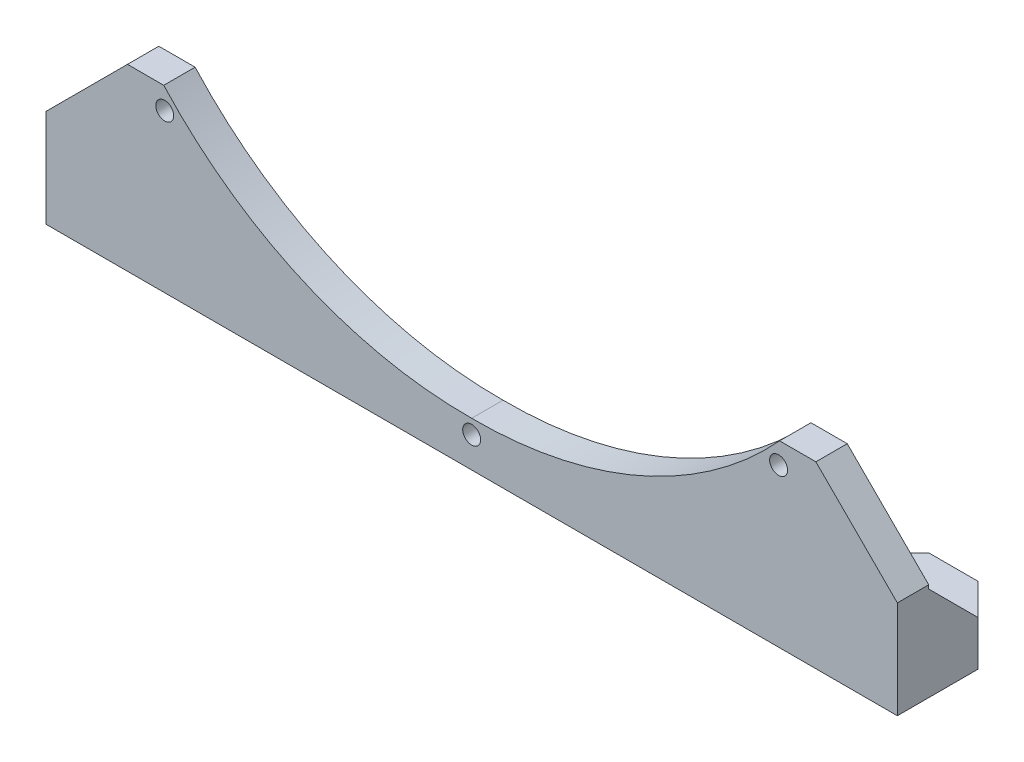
ISO-10303-21;
HEADER;
FILE_DESCRIPTION(('STEP AP214'),'2;1');
FILE_NAME('part.step','',(''),(''),'','','');
FILE_SCHEMA(('AUTOMOTIVE_DESIGN { 1 0 10303 214 1 1 1 1 }'));
ENDSEC;
DATA;
#1=APPLICATION_CONTEXT('core data for automotive mechanical design processes');
#2=APPLICATION_PROTOCOL_DEFINITION('international standard','automotive_design',2000,#1);
#3=PRODUCT_CONTEXT('',#1,'mechanical');
#4=PRODUCT('Part','Part','',(#3));
#5=PRODUCT_RELATED_PRODUCT_CATEGORY('part','',(#4));
#6=PRODUCT_DEFINITION_FORMATION('','',#4);
#7=PRODUCT_DEFINITION_CONTEXT('part definition',#1,'design');
#8=PRODUCT_DEFINITION('design','',#6,#7);
#9=PRODUCT_DEFINITION_SHAPE('','',#8);
#10=(LENGTH_UNIT() NAMED_UNIT(*) SI_UNIT(.MILLI.,.METRE.));
#11=(NAMED_UNIT(*) PLANE_ANGLE_UNIT() SI_UNIT($,.RADIAN.));
#12=(NAMED_UNIT(*) SI_UNIT($,.STERADIAN.) SOLID_ANGLE_UNIT());
#13=UNCERTAINTY_MEASURE_WITH_UNIT(LENGTH_MEASURE(1.E-05),#10,'distance_accuracy_value','');
#14=(GEOMETRIC_REPRESENTATION_CONTEXT(3) GLOBAL_UNCERTAINTY_ASSIGNED_CONTEXT((#13)) GLOBAL_UNIT_ASSIGNED_CONTEXT((#10,
#11,#12)) REPRESENTATION_CONTEXT('',''));
#15=CARTESIAN_POINT('',(0.,0.,0.));
#16=DIRECTION('',(0.,0.,1.));
#17=DIRECTION('',(1.,0.,0.));
#18=AXIS2_PLACEMENT_3D('',#15,#16,#17);
#19=CARTESIAN_POINT('',(0.,-123.0376,8.89));
#20=DIRECTION('',(0.,0.,-1.));
#21=DIRECTION('',(-1.,0.,0.));
#22=AXIS2_PLACEMENT_3D('',#19,#20,#21);
#23=CYLINDRICAL_SURFACE('',#22,2.286);
#24=CARTESIAN_POINT('',(0.,-123.0376,0.));
#25=DIRECTION('',(0.,0.,1.));
#26=DIRECTION('',(1.,0.,0.));
#27=AXIS2_PLACEMENT_3D('',#24,#25,#26);
#28=CIRCLE('',#27,2.286);
#29=CARTESIAN_POINT('',(2.28600000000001,-123.0376,0.));
#30=VERTEX_POINT('',#29);
#31=EDGE_CURVE('E232',#30,#30,#28,.T.);
#32=ORIENTED_EDGE('',*,*,#31,.F.);
#33=EDGE_LOOP('',(#32));
#34=FACE_BOUND('',#33,.T.);
#35=CARTESIAN_POINT('',(0.,-123.0376,4.318));
#36=DIRECTION('',(0.,0.,1.));
#37=DIRECTION('',(1.,0.,0.));
#38=AXIS2_PLACEMENT_3D('',#35,#36,#37);
#39=CIRCLE('',#38,2.286);
#40=CARTESIAN_POINT('',(2.28600000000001,-123.0376,4.318));
#41=VERTEX_POINT('',#40);
#42=EDGE_CURVE('E337',#41,#41,#39,.T.);
#43=ORIENTED_EDGE('',*,*,#42,.T.);
#44=EDGE_LOOP('',(#43));
#45=FACE_BOUND('',#44,.T.);
#46=ADVANCED_FACE('F33',(#34,#45),#23,.F.);
#47=CARTESIAN_POINT('',(-87.0007213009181,-87.0007213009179,8.89));
#48=DIRECTION('',(0.,0.,-1.));
#49=DIRECTION('',(-1.,0.,0.));
#50=AXIS2_PLACEMENT_3D('',#47,#48,#49);
#51=CYLINDRICAL_SURFACE('',#50,2.28599999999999);
#52=CARTESIAN_POINT('',(-87.0007213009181,-87.0007213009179,0.));
#53=DIRECTION('',(0.,0.,1.));
#54=DIRECTION('',(1.,0.,0.));
#55=AXIS2_PLACEMENT_3D('',#52,#53,#54);
#56=CIRCLE('',#55,2.28599999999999);
#57=CARTESIAN_POINT('',(-84.7147213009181,-87.0007213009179,0.));
#58=VERTEX_POINT('',#57);
#59=EDGE_CURVE('E229',#58,#58,#56,.T.);
#60=ORIENTED_EDGE('',*,*,#59,.F.);
#61=EDGE_LOOP('',(#60));
#62=FACE_BOUND('',#61,.T.);
#63=CARTESIAN_POINT('',(-87.0007213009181,-87.0007213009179,4.318));
#64=DIRECTION('',(0.,0.,1.));
#65=DIRECTION('',(1.,0.,0.));
#66=AXIS2_PLACEMENT_3D('',#63,#64,#65);
#67=CIRCLE('',#66,2.28599999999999);
#68=CARTESIAN_POINT('',(-84.7147213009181,-87.0007213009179,4.318));
#69=VERTEX_POINT('',#68);
#70=EDGE_CURVE('E371',#69,#69,#67,.T.);
#71=ORIENTED_EDGE('',*,*,#70,.T.);
#72=EDGE_LOOP('',(#71));
#73=FACE_BOUND('',#72,.T.);
#74=ADVANCED_FACE('F393',(#62,#73),#51,.F.);
#75=CARTESIAN_POINT('',(87.0007213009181,-87.0007213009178,8.89));
#76=DIRECTION('',(0.,0.,-1.));
#77=DIRECTION('',(-1.,0.,0.));
#78=AXIS2_PLACEMENT_3D('',#75,#76,#77);
#79=CYLINDRICAL_SURFACE('',#78,2.28599999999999);
#80=CARTESIAN_POINT('',(87.0007213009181,-87.0007213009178,0.));
#81=DIRECTION('',(0.,0.,1.));
#82=DIRECTION('',(-1.,0.,0.));
#83=AXIS2_PLACEMENT_3D('',#80,#81,#82);
#84=CIRCLE('',#83,2.28599999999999);
#85=CARTESIAN_POINT('',(84.7147213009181,-87.0007213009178,0.));
#86=VERTEX_POINT('',#85);
#87=EDGE_CURVE('E224',#86,#86,#84,.T.);
#88=ORIENTED_EDGE('',*,*,#87,.F.);
#89=EDGE_LOOP('',(#88));
#90=FACE_BOUND('',#89,.T.);
#91=CARTESIAN_POINT('',(87.0007213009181,-87.0007213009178,4.318));
#92=DIRECTION('',(0.,0.,1.));
#93=DIRECTION('',(1.,0.,0.));
#94=AXIS2_PLACEMENT_3D('',#91,#92,#93);
#95=CIRCLE('',#94,2.28599999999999);
#96=CARTESIAN_POINT('',(89.2867213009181,-87.0007213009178,4.318));
#97=VERTEX_POINT('',#96);
#98=EDGE_CURVE('E192',#97,#97,#95,.T.);
#99=ORIENTED_EDGE('',*,*,#98,.T.);
#100=EDGE_LOOP('',(#99));
#101=FACE_BOUND('',#100,.T.);
#102=ADVANCED_FACE('F399',(#90,#101),#79,.F.);
#103=CARTESIAN_POINT('',(-0.948520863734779,-2.17249578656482,8.89));
#104=DIRECTION('',(0.,0.,1.));
#105=DIRECTION('',(1.,0.,0.));
#106=AXIS2_PLACEMENT_3D('',#103,#104,#105);
#107=PLANE('',#106);
#108=CARTESIAN_POINT('',(-87.0007213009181,-87.0007213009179,8.89));
#109=DIRECTION('',(0.,0.,1.));
#110=DIRECTION('',(1.,0.,0.));
#111=AXIS2_PLACEMENT_3D('',#108,#109,#110);
#112=CIRCLE('',#111,2.53999999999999);
#113=CARTESIAN_POINT('',(-84.4607213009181,-87.0007213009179,8.89));
#114=VERTEX_POINT('',#113);
#115=EDGE_CURVE('E193',#114,#114,#112,.T.);
#116=ORIENTED_EDGE('',*,*,#115,.F.);
#117=EDGE_LOOP('',(#116));
#118=FACE_BOUND('',#117,.T.);
#119=CARTESIAN_POINT('',(0.,-123.0376,8.89));
#120=DIRECTION('',(0.,0.,1.));
#121=DIRECTION('',(1.,0.,0.));
#122=AXIS2_PLACEMENT_3D('',#119,#120,#121);
#123=CIRCLE('',#122,2.54);
#124=CARTESIAN_POINT('',(2.54000000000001,-123.0376,8.89));
#125=VERTEX_POINT('',#124);
#126=EDGE_CURVE('E199',#125,#125,#123,.T.);
#127=ORIENTED_EDGE('',*,*,#126,.F.);
#128=EDGE_LOOP('',(#127));
#129=FACE_BOUND('',#128,.T.);
#130=CARTESIAN_POINT('',(87.0007213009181,-87.0007213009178,8.89));
#131=DIRECTION('',(0.,0.,1.));
#132=DIRECTION('',(1.,0.,0.));
#133=AXIS2_PLACEMENT_3D('',#130,#131,#132);
#134=CIRCLE('',#133,2.53999999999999);
#135=CARTESIAN_POINT('',(89.5407213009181,-87.0007213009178,8.89));
#136=VERTEX_POINT('',#135);
#137=EDGE_CURVE('E188',#136,#136,#134,.T.);
#138=ORIENTED_EDGE('',*,*,#137,.F.);
#139=EDGE_LOOP('',(#138));
#140=FACE_BOUND('',#139,.T.);
#141=DIRECTION('',(1.,0.,0.));
#142=VECTOR('',#141,1.);
#143=CARTESIAN_POINT('',(120.65,-131.708645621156,8.89));
#144=LINE('',#143,#142);
#145=CARTESIAN_POINT('',(-120.65,-131.708645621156,8.89));
#146=VERTEX_POINT('',#145);
#147=CARTESIAN_POINT('',(120.65,-131.708645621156,8.89));
#148=VERTEX_POINT('',#147);
#149=EDGE_CURVE('E246',#146,#148,#144,.T.);
#150=ORIENTED_EDGE('',*,*,#149,.T.);
#151=DIRECTION('',(0.,1.,0.));
#152=VECTOR('',#151,1.);
#153=CARTESIAN_POINT('',(120.65,-131.708645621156,8.89));
#154=LINE('',#153,#152);
#155=CARTESIAN_POINT('',(120.65,-103.996642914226,8.89));
#156=VERTEX_POINT('',#155);
#157=EDGE_CURVE('E248',#148,#156,#154,.T.);
#158=ORIENTED_EDGE('',*,*,#157,.T.);
#159=DIRECTION('',(-0.707106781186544,0.707106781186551,0.));
#160=VECTOR('',#159,1.);
#161=CARTESIAN_POINT('',(97.5620027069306,-80.9086456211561,8.89));
#162=LINE('',#161,#160);
#163=CARTESIAN_POINT('',(97.5620027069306,-80.9086456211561,8.89));
#164=VERTEX_POINT('',#163);
#165=EDGE_CURVE('E250',#156,#164,#162,.T.);
#166=ORIENTED_EDGE('',*,*,#165,.T.);
#167=DIRECTION('',(-1.,0.,0.));
#168=VECTOR('',#167,1.);
#169=CARTESIAN_POINT('',(87.2746716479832,-80.9086456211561,8.89));
#170=LINE('',#169,#168);
#171=CARTESIAN_POINT('',(87.2746716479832,-80.9086456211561,8.89));
#172=VERTEX_POINT('',#171);
#173=EDGE_CURVE('E252',#164,#172,#170,.T.);
#174=ORIENTED_EDGE('',*,*,#173,.T.);
#175=CARTESIAN_POINT('',(0.94852086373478,-2.17249578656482,8.89));
#176=DIRECTION('',(0.,0.,-1.));
#177=DIRECTION('',(-1.,0.,0.));
#178=AXIS2_PLACEMENT_3D('',#175,#176,#177);
#179=CIRCLE('',#178,116.84);
#180=CARTESIAN_POINT('',(0.,-119.008645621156,8.89));
#181=VERTEX_POINT('',#180);
#182=EDGE_CURVE('E254',#172,#181,#179,.T.);
#183=ORIENTED_EDGE('',*,*,#182,.T.);
#184=CARTESIAN_POINT('',(-0.948520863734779,-2.17249578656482,8.89));
#185=DIRECTION('',(0.,0.,-1.));
#186=DIRECTION('',(1.,0.,0.));
#187=AXIS2_PLACEMENT_3D('',#184,#185,#186);
#188=CIRCLE('',#187,116.84);
#189=CARTESIAN_POINT('',(-87.2746716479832,-80.9086456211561,8.89));
#190=VERTEX_POINT('',#189);
#191=EDGE_CURVE('E236',#181,#190,#188,.T.);
#192=ORIENTED_EDGE('',*,*,#191,.T.);
#193=DIRECTION('',(-1.,0.,0.));
#194=VECTOR('',#193,1.);
#195=CARTESIAN_POINT('',(-87.2746716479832,-80.9086456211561,8.89));
#196=LINE('',#195,#194);
#197=CARTESIAN_POINT('',(-97.56200270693,-80.908645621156,8.89));
#198=VERTEX_POINT('',#197);
#199=EDGE_CURVE('E239',#190,#198,#196,.T.);
#200=ORIENTED_EDGE('',*,*,#199,.T.);
#201=DIRECTION('',(-0.707106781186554,-0.707106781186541,0.));
#202=VECTOR('',#201,1.);
#203=CARTESIAN_POINT('',(-97.56200270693,-80.908645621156,8.89));
#204=LINE('',#203,#202);
#205=CARTESIAN_POINT('',(-120.65,-103.996642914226,8.89));
#206=VERTEX_POINT('',#205);
#207=EDGE_CURVE('E242',#198,#206,#204,.T.);
#208=ORIENTED_EDGE('',*,*,#207,.T.);
#209=DIRECTION('',(0.,-1.,0.));
#210=VECTOR('',#209,1.);
#211=CARTESIAN_POINT('',(-120.65,-131.708645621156,8.89));
#212=LINE('',#211,#210);
#213=EDGE_CURVE('E244',#206,#146,#212,.T.);
#214=ORIENTED_EDGE('',*,*,#213,.T.);
#215=EDGE_LOOP('',(#150,#158,#166,#174,#183,#192,#200,#208,#214));
#216=FACE_BOUND('',#215,.T.);
#217=ADVANCED_FACE('F406',(#118,#129,#140,#216),#107,.T.);
#218=CARTESIAN_POINT('',(-0.948520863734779,-2.17249578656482,0.));
#219=DIRECTION('',(0.,0.,1.));
#220=DIRECTION('',(1.,0.,0.));
#221=AXIS2_PLACEMENT_3D('',#218,#219,#220);
#222=PLANE('',#221);
#223=DIRECTION('',(1.,0.,0.));
#224=VECTOR('',#223,1.);
#225=CARTESIAN_POINT('',(120.65,-131.708645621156,0.));
#226=LINE('',#225,#224);
#227=CARTESIAN_POINT('',(-74.93,-131.708645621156,0.));
#228=VERTEX_POINT('',#227);
#229=CARTESIAN_POINT('',(74.9299999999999,-131.708645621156,0.));
#230=VERTEX_POINT('',#229);
#231=EDGE_CURVE('E266',#228,#230,#226,.T.);
#232=ORIENTED_EDGE('',*,*,#231,.F.);
#233=DIRECTION('',(0.,1.,0.));
#234=VECTOR('',#233,1.);
#235=CARTESIAN_POINT('',(-74.9300000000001,-2.17249578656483,0.));
#236=LINE('',#235,#234);
#237=CARTESIAN_POINT('',(-74.9300000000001,-105.038645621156,0.));
#238=VERTEX_POINT('',#237);
#239=EDGE_CURVE('E309',#228,#238,#236,.T.);
#240=ORIENTED_EDGE('',*,*,#239,.T.);
#241=DIRECTION('',(-1.,0.,0.));
#242=VECTOR('',#241,1.);
#243=CARTESIAN_POINT('',(-120.65,-105.038645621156,0.));
#244=LINE('',#243,#242);
#245=CARTESIAN_POINT('',(-120.65,-105.038645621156,0.));
#246=VERTEX_POINT('',#245);
#247=EDGE_CURVE('E307',#238,#246,#244,.T.);
#248=ORIENTED_EDGE('',*,*,#247,.T.);
#249=DIRECTION('',(0.,-1.,0.));
#250=VECTOR('',#249,1.);
#251=CARTESIAN_POINT('',(-120.65,-131.708645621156,0.));
#252=LINE('',#251,#250);
#253=CARTESIAN_POINT('',(-120.65,-103.996642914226,0.));
#254=VERTEX_POINT('',#253);
#255=EDGE_CURVE('E263',#254,#246,#252,.T.);
#256=ORIENTED_EDGE('',*,*,#255,.F.);
#257=DIRECTION('',(-0.707106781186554,-0.707106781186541,0.));
#258=VECTOR('',#257,1.);
#259=CARTESIAN_POINT('',(-97.56200270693,-80.908645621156,0.));
#260=LINE('',#259,#258);
#261=CARTESIAN_POINT('',(-97.56200270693,-80.908645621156,0.));
#262=VERTEX_POINT('',#261);
#263=EDGE_CURVE('E261',#262,#254,#260,.T.);
#264=ORIENTED_EDGE('',*,*,#263,.F.);
#265=DIRECTION('',(-1.,0.,0.));
#266=VECTOR('',#265,1.);
#267=CARTESIAN_POINT('',(-87.2746716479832,-80.9086456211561,0.));
#268=LINE('',#267,#266);
#269=CARTESIAN_POINT('',(-87.2746716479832,-80.9086456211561,0.));
#270=VERTEX_POINT('',#269);
#271=EDGE_CURVE('E259',#270,#262,#268,.T.);
#272=ORIENTED_EDGE('',*,*,#271,.F.);
#273=CARTESIAN_POINT('',(-0.948520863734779,-2.17249578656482,0.));
#274=DIRECTION('',(0.,0.,-1.));
#275=DIRECTION('',(1.,0.,0.));
#276=AXIS2_PLACEMENT_3D('',#273,#274,#275);
#277=CIRCLE('',#276,116.84);
#278=CARTESIAN_POINT('',(0.,-119.008645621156,0.));
#279=VERTEX_POINT('',#278);
#280=EDGE_CURVE('E235',#279,#270,#277,.T.);
#281=ORIENTED_EDGE('',*,*,#280,.F.);
#282=CARTESIAN_POINT('',(0.94852086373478,-2.17249578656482,0.));
#283=DIRECTION('',(0.,0.,-1.));
#284=DIRECTION('',(-1.,0.,0.));
#285=AXIS2_PLACEMENT_3D('',#282,#283,#284);
#286=CIRCLE('',#285,116.84);
#287=CARTESIAN_POINT('',(87.2746716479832,-80.9086456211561,0.));
#288=VERTEX_POINT('',#287);
#289=EDGE_CURVE('E240',#288,#279,#286,.T.);
#290=ORIENTED_EDGE('',*,*,#289,.F.);
#291=DIRECTION('',(-1.,0.,0.));
#292=VECTOR('',#291,1.);
#293=CARTESIAN_POINT('',(87.2746716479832,-80.9086456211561,0.));
#294=LINE('',#293,#292);
#295=CARTESIAN_POINT('',(97.5620027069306,-80.9086456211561,0.));
#296=VERTEX_POINT('',#295);
#297=EDGE_CURVE('E273',#296,#288,#294,.T.);
#298=ORIENTED_EDGE('',*,*,#297,.F.);
#299=DIRECTION('',(-0.707106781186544,0.707106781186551,0.));
#300=VECTOR('',#299,1.);
#301=CARTESIAN_POINT('',(97.5620027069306,-80.9086456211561,0.));
#302=LINE('',#301,#300);
#303=CARTESIAN_POINT('',(120.65,-103.996642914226,0.));
#304=VERTEX_POINT('',#303);
#305=EDGE_CURVE('E271',#304,#296,#302,.T.);
#306=ORIENTED_EDGE('',*,*,#305,.F.);
#307=DIRECTION('',(0.,1.,0.));
#308=VECTOR('',#307,1.);
#309=CARTESIAN_POINT('',(120.65,-131.708645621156,0.));
#310=LINE('',#309,#308);
#311=CARTESIAN_POINT('',(120.65,-105.038645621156,0.));
#312=VERTEX_POINT('',#311);
#313=EDGE_CURVE('E269',#312,#304,#310,.T.);
#314=ORIENTED_EDGE('',*,*,#313,.F.);
#315=DIRECTION('',(-1.,0.,0.));
#316=VECTOR('',#315,1.);
#317=CARTESIAN_POINT('',(-0.948520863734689,-105.038645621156,0.));
#318=LINE('',#317,#316);
#319=CARTESIAN_POINT('',(74.9299999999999,-105.038645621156,0.));
#320=VERTEX_POINT('',#319);
#321=EDGE_CURVE('E302',#312,#320,#318,.T.);
#322=ORIENTED_EDGE('',*,*,#321,.T.);
#323=DIRECTION('',(0.,-1.,0.));
#324=VECTOR('',#323,1.);
#325=CARTESIAN_POINT('',(74.9299999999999,-2.17249578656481,0.));
#326=LINE('',#325,#324);
#327=EDGE_CURVE('E304',#320,#230,#326,.T.);
#328=ORIENTED_EDGE('',*,*,#327,.T.);
#329=EDGE_LOOP('',(#232,#240,#248,#256,#264,#272,#281,#290,#298,#306,#314,#322,#328));
#330=FACE_BOUND('',#329,.T.);
#331=ORIENTED_EDGE('',*,*,#31,.T.);
#332=EDGE_LOOP('',(#331));
#333=FACE_BOUND('',#332,.T.);
#334=ORIENTED_EDGE('',*,*,#59,.T.);
#335=EDGE_LOOP('',(#334));
#336=FACE_BOUND('',#335,.T.);
#337=ORIENTED_EDGE('',*,*,#87,.T.);
#338=EDGE_LOOP('',(#337));
#339=FACE_BOUND('',#338,.T.);
#340=ADVANCED_FACE('F409',(#330,#333,#336,#339),#222,.F.);
#341=CARTESIAN_POINT('',(-0.948520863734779,-2.17249578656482,8.89));
#342=DIRECTION('',(0.,0.,-1.));
#343=DIRECTION('',(-1.,0.,0.));
#344=AXIS2_PLACEMENT_3D('',#341,#342,#343);
#345=CYLINDRICAL_SURFACE('',#344,116.84);
#346=ORIENTED_EDGE('',*,*,#280,.T.);
#347=DIRECTION('',(0.,0.,-1.));
#348=VECTOR('',#347,1.);
#349=CARTESIAN_POINT('',(-87.2746716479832,-80.9086456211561,8.89));
#350=LINE('',#349,#348);
#351=EDGE_CURVE('E299',#190,#270,#350,.T.);
#352=ORIENTED_EDGE('',*,*,#351,.F.);
#353=ORIENTED_EDGE('',*,*,#191,.F.);
#354=DIRECTION('',(0.,0.,-1.));
#355=VECTOR('',#354,1.);
#356=CARTESIAN_POINT('',(0.,-119.008645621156,8.89));
#357=LINE('',#356,#355);
#358=EDGE_CURVE('E256',#181,#279,#357,.T.);
#359=ORIENTED_EDGE('',*,*,#358,.T.);
#360=EDGE_LOOP('',(#346,#352,#353,#359));
#361=FACE_BOUND('',#360,.T.);
#362=ADVANCED_FACE('F413',(#361),#345,.F.);
#363=CARTESIAN_POINT('',(-87.2746716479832,-80.9086456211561,8.89));
#364=DIRECTION('',(0.,-1.,0.));
#365=DIRECTION('',(1.,0.,0.));
#366=AXIS2_PLACEMENT_3D('',#363,#364,#365);
#367=PLANE('',#366);
#368=ORIENTED_EDGE('',*,*,#271,.T.);
#369=DIRECTION('',(0.,0.,-1.));
#370=VECTOR('',#369,1.);
#371=CARTESIAN_POINT('',(-97.56200270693,-80.908645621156,8.89));
#372=LINE('',#371,#370);
#373=EDGE_CURVE('E296',#198,#262,#372,.T.);
#374=ORIENTED_EDGE('',*,*,#373,.F.);
#375=ORIENTED_EDGE('',*,*,#199,.F.);
#376=ORIENTED_EDGE('',*,*,#351,.T.);
#377=EDGE_LOOP('',(#368,#374,#375,#376));
#378=FACE_BOUND('',#377,.T.);
#379=ADVANCED_FACE('F443',(#378),#367,.F.);
#380=CARTESIAN_POINT('',(-97.56200270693,-80.908645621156,8.89));
#381=DIRECTION('',(0.707106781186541,-0.707106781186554,0.));
#382=DIRECTION('',(0.707106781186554,0.707106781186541,0.));
#383=AXIS2_PLACEMENT_3D('',#380,#381,#382);
#384=PLANE('',#383);
#385=ORIENTED_EDGE('',*,*,#263,.T.);
#386=DIRECTION('',(0.,0.,-1.));
#387=VECTOR('',#386,1.);
#388=CARTESIAN_POINT('',(-120.65,-103.996642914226,8.89));
#389=LINE('',#388,#387);
#390=EDGE_CURVE('E293',#206,#254,#389,.T.);
#391=ORIENTED_EDGE('',*,*,#390,.F.);
#392=ORIENTED_EDGE('',*,*,#207,.F.);
#393=ORIENTED_EDGE('',*,*,#373,.T.);
#394=EDGE_LOOP('',(#385,#391,#392,#393));
#395=FACE_BOUND('',#394,.T.);
#396=ADVANCED_FACE('F439',(#395),#384,.F.);
#397=CARTESIAN_POINT('',(-120.65,-131.708645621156,8.89));
#398=DIRECTION('',(1.,0.,0.));
#399=DIRECTION('',(0.,1.,0.));
#400=AXIS2_PLACEMENT_3D('',#397,#398,#399);
#401=PLANE('',#400);
#402=DIRECTION('',(0.,0.707106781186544,0.707106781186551));
#403=VECTOR('',#402,1.);
#404=CARTESIAN_POINT('',(-120.65,-113.928645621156,-8.88999999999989));
#405=LINE('',#404,#403);
#406=CARTESIAN_POINT('',(-120.65,-119.008645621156,-13.97));
#407=VERTEX_POINT('',#406);
#408=EDGE_CURVE('E324',#246,#407,#405,.F.);
#409=ORIENTED_EDGE('',*,*,#408,.T.);
#410=DIRECTION('',(0.,-1.,0.));
#411=VECTOR('',#410,1.);
#412=CARTESIAN_POINT('',(-120.65,-131.708645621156,-13.97));
#413=LINE('',#412,#411);
#414=CARTESIAN_POINT('',(-120.65,-131.708645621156,-13.97));
#415=VERTEX_POINT('',#414);
#416=EDGE_CURVE('E354',#407,#415,#413,.T.);
#417=ORIENTED_EDGE('',*,*,#416,.T.);
#418=DIRECTION('',(0.,0.,-1.));
#419=VECTOR('',#418,1.);
#420=CARTESIAN_POINT('',(-120.65,-131.708645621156,8.89));
#421=LINE('',#420,#419);
#422=EDGE_CURVE('E290',#146,#415,#421,.T.);
#423=ORIENTED_EDGE('',*,*,#422,.F.);
#424=ORIENTED_EDGE('',*,*,#213,.F.);
#425=ORIENTED_EDGE('',*,*,#390,.T.);
#426=ORIENTED_EDGE('',*,*,#255,.T.);
#427=EDGE_LOOP('',(#409,#417,#423,#424,#425,#426));
#428=FACE_BOUND('',#427,.T.);
#429=ADVANCED_FACE('F435',(#428),#401,.F.);
#430=CARTESIAN_POINT('',(120.65,-131.708645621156,8.89));
#431=DIRECTION('',(0.,1.,0.));
#432=DIRECTION('',(-1.,0.,0.));
#433=AXIS2_PLACEMENT_3D('',#430,#431,#432);
#434=PLANE('',#433);
#435=DIRECTION('',(1.,0.,0.));
#436=VECTOR('',#435,1.);
#437=CARTESIAN_POINT('',(-120.65,-131.708645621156,-22.86));
#438=LINE('',#437,#436);
#439=CARTESIAN_POINT('',(-111.76,-131.708645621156,-22.86));
#440=VERTEX_POINT('',#439);
#441=CARTESIAN_POINT('',(-97.79,-131.708645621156,-22.86));
#442=VERTEX_POINT('',#441);
#443=EDGE_CURVE('E210',#440,#442,#438,.T.);
#444=ORIENTED_EDGE('',*,*,#443,.T.);
#445=DIRECTION('',(-0.707106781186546,0.,-0.707106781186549));
#446=VECTOR('',#445,1.);
#447=CARTESIAN_POINT('',(-97.79,-131.708645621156,-22.86));
#448=LINE('',#447,#446);
#449=CARTESIAN_POINT('',(-88.9,-131.708645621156,-13.97));
#450=VERTEX_POINT('',#449);
#451=EDGE_CURVE('E348',#442,#450,#448,.F.);
#452=ORIENTED_EDGE('',*,*,#451,.T.);
#453=DIRECTION('',(0.707106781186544,0.,0.707106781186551));
#454=VECTOR('',#453,1.);
#455=CARTESIAN_POINT('',(27.304999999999,-131.708645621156,102.235));
#456=LINE('',#455,#454);
#457=EDGE_CURVE('E322',#450,#228,#456,.T.);
#458=ORIENTED_EDGE('',*,*,#457,.T.);
#459=ORIENTED_EDGE('',*,*,#231,.T.);
#460=DIRECTION('',(0.707106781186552,0.,-0.707106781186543));
#461=VECTOR('',#460,1.);
#462=CARTESIAN_POINT('',(93.3450000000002,-131.708645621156,-18.4150000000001));
#463=LINE('',#462,#461);
#464=CARTESIAN_POINT('',(88.9,-131.708645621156,-13.9699999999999));
#465=VERTEX_POINT('',#464);
#466=EDGE_CURVE('E327',#230,#465,#463,.T.);
#467=ORIENTED_EDGE('',*,*,#466,.T.);
#468=DIRECTION('',(-0.707106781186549,0.,0.707106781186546));
#469=VECTOR('',#468,1.);
#470=CARTESIAN_POINT('',(88.9,-131.708645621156,-13.97));
#471=LINE('',#470,#469);
#472=CARTESIAN_POINT('',(97.79,-131.708645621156,-22.86));
#473=VERTEX_POINT('',#472);
#474=EDGE_CURVE('E342',#465,#473,#471,.F.);
#475=ORIENTED_EDGE('',*,*,#474,.T.);
#476=DIRECTION('',(1.,0.,0.));
#477=VECTOR('',#476,1.);
#478=CARTESIAN_POINT('',(120.65,-131.708645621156,-22.86));
#479=LINE('',#478,#477);
#480=CARTESIAN_POINT('',(111.76,-131.708645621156,-22.86));
#481=VERTEX_POINT('',#480);
#482=EDGE_CURVE('E220',#473,#481,#479,.T.);
#483=ORIENTED_EDGE('',*,*,#482,.T.);
#484=DIRECTION('',(0.707106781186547,0.,0.707106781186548));
#485=VECTOR('',#484,1.);
#486=CARTESIAN_POINT('',(111.76,-131.708645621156,-22.86));
#487=LINE('',#486,#485);
#488=CARTESIAN_POINT('',(120.65,-131.708645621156,-13.97));
#489=VERTEX_POINT('',#488);
#490=EDGE_CURVE('E344',#481,#489,#487,.T.);
#491=ORIENTED_EDGE('',*,*,#490,.T.);
#492=DIRECTION('',(0.,0.,-1.));
#493=VECTOR('',#492,1.);
#494=CARTESIAN_POINT('',(120.65,-131.708645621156,8.89));
#495=LINE('',#494,#493);
#496=EDGE_CURVE('E287',#148,#489,#495,.T.);
#497=ORIENTED_EDGE('',*,*,#496,.F.);
#498=ORIENTED_EDGE('',*,*,#149,.F.);
#499=ORIENTED_EDGE('',*,*,#422,.T.);
#500=DIRECTION('',(0.707106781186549,0.,-0.707106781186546));
#501=VECTOR('',#500,1.);
#502=CARTESIAN_POINT('',(-120.65,-131.708645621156,-13.97));
#503=LINE('',#502,#501);
#504=EDGE_CURVE('E346',#415,#440,#503,.T.);
#505=ORIENTED_EDGE('',*,*,#504,.T.);
#506=EDGE_LOOP('',(#444,#452,#458,#459,#467,#475,#483,#491,#497,#498,#499,#505));
#507=FACE_BOUND('',#506,.T.);
#508=CARTESIAN_POINT('',(104.775,-131.708645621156,-10.16));
#509=DIRECTION('',(0.,-1.,0.));
#510=DIRECTION('',(1.,0.,0.));
#511=AXIS2_PLACEMENT_3D('',#508,#509,#510);
#512=CIRCLE('',#511,3.429);
#513=CARTESIAN_POINT('',(108.204,-131.708645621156,-10.16));
#514=VERTEX_POINT('',#513);
#515=EDGE_CURVE('E215',#514,#514,#512,.T.);
#516=ORIENTED_EDGE('',*,*,#515,.F.);
#517=EDGE_LOOP('',(#516));
#518=FACE_BOUND('',#517,.T.);
#519=CARTESIAN_POINT('',(-104.775,-131.708645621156,-10.16));
#520=DIRECTION('',(0.,-1.,0.));
#521=DIRECTION('',(-1.,0.,0.));
#522=AXIS2_PLACEMENT_3D('',#519,#520,#521);
#523=CIRCLE('',#522,3.429);
#524=CARTESIAN_POINT('',(-108.204,-131.708645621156,-10.16));
#525=VERTEX_POINT('',#524);
#526=EDGE_CURVE('E207',#525,#525,#523,.T.);
#527=ORIENTED_EDGE('',*,*,#526,.F.);
#528=EDGE_LOOP('',(#527));
#529=FACE_BOUND('',#528,.T.);
#530=ADVANCED_FACE('F431',(#507,#518,#529),#434,.F.);
#531=CARTESIAN_POINT('',(120.65,-131.708645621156,8.89));
#532=DIRECTION('',(-1.,0.,0.));
#533=DIRECTION('',(0.,-1.,0.));
#534=AXIS2_PLACEMENT_3D('',#531,#532,#533);
#535=PLANE('',#534);
#536=DIRECTION('',(0.,0.707106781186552,0.707106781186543));
#537=VECTOR('',#536,1.);
#538=CARTESIAN_POINT('',(120.65,-113.928645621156,-8.8900000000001));
#539=LINE('',#538,#537);
#540=CARTESIAN_POINT('',(120.65,-119.008645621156,-13.9699999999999));
#541=VERTEX_POINT('',#540);
#542=EDGE_CURVE('E330',#541,#312,#539,.T.);
#543=ORIENTED_EDGE('',*,*,#542,.T.);
#544=ORIENTED_EDGE('',*,*,#313,.T.);
#545=DIRECTION('',(0.,0.,-1.));
#546=VECTOR('',#545,1.);
#547=CARTESIAN_POINT('',(120.65,-103.996642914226,8.89));
#548=LINE('',#547,#546);
#549=EDGE_CURVE('E284',#156,#304,#548,.T.);
#550=ORIENTED_EDGE('',*,*,#549,.F.);
#551=ORIENTED_EDGE('',*,*,#157,.F.);
#552=ORIENTED_EDGE('',*,*,#496,.T.);
#553=DIRECTION('',(0.,1.,0.));
#554=VECTOR('',#553,1.);
#555=CARTESIAN_POINT('',(120.65,-119.008645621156,-13.97));
#556=LINE('',#555,#554);
#557=EDGE_CURVE('E362',#489,#541,#556,.T.);
#558=ORIENTED_EDGE('',*,*,#557,.T.);
#559=EDGE_LOOP('',(#543,#544,#550,#551,#552,#558));
#560=FACE_BOUND('',#559,.T.);
#561=ADVANCED_FACE('F427',(#560),#535,.F.);
#562=CARTESIAN_POINT('',(97.5620027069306,-80.9086456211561,8.89));
#563=DIRECTION('',(-0.707106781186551,-0.707106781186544,0.));
#564=DIRECTION('',(0.707106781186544,-0.707106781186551,0.));
#565=AXIS2_PLACEMENT_3D('',#562,#563,#564);
#566=PLANE('',#565);
#567=ORIENTED_EDGE('',*,*,#305,.T.);
#568=DIRECTION('',(0.,0.,-1.));
#569=VECTOR('',#568,1.);
#570=CARTESIAN_POINT('',(97.5620027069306,-80.9086456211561,8.89));
#571=LINE('',#570,#569);
#572=EDGE_CURVE('E281',#164,#296,#571,.T.);
#573=ORIENTED_EDGE('',*,*,#572,.F.);
#574=ORIENTED_EDGE('',*,*,#165,.F.);
#575=ORIENTED_EDGE('',*,*,#549,.T.);
#576=EDGE_LOOP('',(#567,#573,#574,#575));
#577=FACE_BOUND('',#576,.T.);
#578=ADVANCED_FACE('F423',(#577),#566,.F.);
#579=CARTESIAN_POINT('',(87.2746716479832,-80.9086456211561,8.89));
#580=DIRECTION('',(0.,-1.,0.));
#581=DIRECTION('',(0.,0.,-1.));
#582=AXIS2_PLACEMENT_3D('',#579,#580,#581);
#583=PLANE('',#582);
#584=ORIENTED_EDGE('',*,*,#297,.T.);
#585=DIRECTION('',(0.,0.,-1.));
#586=VECTOR('',#585,1.);
#587=CARTESIAN_POINT('',(87.2746716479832,-80.9086456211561,8.89));
#588=LINE('',#587,#586);
#589=EDGE_CURVE('E278',#172,#288,#588,.T.);
#590=ORIENTED_EDGE('',*,*,#589,.F.);
#591=ORIENTED_EDGE('',*,*,#173,.F.);
#592=ORIENTED_EDGE('',*,*,#572,.T.);
#593=EDGE_LOOP('',(#584,#590,#591,#592));
#594=FACE_BOUND('',#593,.T.);
#595=ADVANCED_FACE('F419',(#594),#583,.F.);
#596=CARTESIAN_POINT('',(0.94852086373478,-2.17249578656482,8.89));
#597=DIRECTION('',(0.,0.,-1.));
#598=DIRECTION('',(-1.,0.,0.));
#599=AXIS2_PLACEMENT_3D('',#596,#597,#598);
#600=CYLINDRICAL_SURFACE('',#599,116.84);
#601=ORIENTED_EDGE('',*,*,#289,.T.);
#602=ORIENTED_EDGE('',*,*,#358,.F.);
#603=ORIENTED_EDGE('',*,*,#182,.F.);
#604=ORIENTED_EDGE('',*,*,#589,.T.);
#605=EDGE_LOOP('',(#601,#602,#603,#604));
#606=FACE_BOUND('',#605,.T.);
#607=ADVANCED_FACE('F415',(#606),#600,.F.);
#608=CARTESIAN_POINT('',(1.13677740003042E-13,-119.008645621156,0.));
#609=DIRECTION('',(0.,1.,0.));
#610=DIRECTION('',(-1.,0.,0.));
#611=AXIS2_PLACEMENT_3D('',#608,#609,#610);
#612=PLANE('',#611);
#613=DIRECTION('',(1.,0.,0.));
#614=VECTOR('',#613,1.);
#615=CARTESIAN_POINT('',(1.13677740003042E-13,-119.008645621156,-13.9699999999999));
#616=LINE('',#615,#614);
#617=CARTESIAN_POINT('',(88.9,-119.008645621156,-13.9699999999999));
#618=VERTEX_POINT('',#617);
#619=EDGE_CURVE('E320',#618,#541,#616,.T.);
#620=ORIENTED_EDGE('',*,*,#619,.T.);
#621=DIRECTION('',(-0.707106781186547,0.,-0.707106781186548));
#622=VECTOR('',#621,1.);
#623=CARTESIAN_POINT('',(67.3100000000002,-119.008645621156,-67.3099999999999));
#624=LINE('',#623,#622);
#625=CARTESIAN_POINT('',(111.76,-119.008645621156,-22.86));
#626=VERTEX_POINT('',#625);
#627=EDGE_CURVE('E367',#541,#626,#624,.T.);
#628=ORIENTED_EDGE('',*,*,#627,.T.);
#629=DIRECTION('',(1.,0.,0.));
#630=VECTOR('',#629,1.);
#631=CARTESIAN_POINT('',(120.65,-119.008645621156,-22.86));
#632=LINE('',#631,#630);
#633=CARTESIAN_POINT('',(97.79,-119.008645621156,-22.86));
#634=VERTEX_POINT('',#633);
#635=EDGE_CURVE('E221',#634,#626,#632,.T.);
#636=ORIENTED_EDGE('',*,*,#635,.F.);
#637=DIRECTION('',(0.707106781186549,0.,-0.707106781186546));
#638=VECTOR('',#637,1.);
#639=CARTESIAN_POINT('',(37.4649999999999,-119.008645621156,37.4649999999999));
#640=LINE('',#639,#638);
#641=EDGE_CURVE('E365',#634,#618,#640,.F.);
#642=ORIENTED_EDGE('',*,*,#641,.T.);
#643=EDGE_LOOP('',(#620,#628,#636,#642));
#644=FACE_BOUND('',#643,.T.);
#645=ADVANCED_FACE('F418',(#644),#612,.T.);
#646=CARTESIAN_POINT('',(120.65,-119.008645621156,-22.86));
#647=DIRECTION('',(0.,0.,-1.));
#648=DIRECTION('',(-1.,0.,0.));
#649=AXIS2_PLACEMENT_3D('',#646,#647,#648);
#650=PLANE('',#649);
#651=ORIENTED_EDGE('',*,*,#635,.T.);
#652=DIRECTION('',(0.,-1.,0.));
#653=VECTOR('',#652,1.);
#654=CARTESIAN_POINT('',(111.76,-131.708645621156,-22.86));
#655=LINE('',#654,#653);
#656=EDGE_CURVE('E359',#626,#481,#655,.T.);
#657=ORIENTED_EDGE('',*,*,#656,.T.);
#658=ORIENTED_EDGE('',*,*,#482,.F.);
#659=DIRECTION('',(0.,1.,0.));
#660=VECTOR('',#659,1.);
#661=CARTESIAN_POINT('',(97.79,-119.008645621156,-22.86));
#662=LINE('',#661,#660);
#663=EDGE_CURVE('E357',#473,#634,#662,.T.);
#664=ORIENTED_EDGE('',*,*,#663,.T.);
#665=EDGE_LOOP('',(#651,#657,#658,#664));
#666=FACE_BOUND('',#665,.T.);
#667=ADVANCED_FACE('F490',(#666),#650,.T.);
#668=CARTESIAN_POINT('',(104.775,-119.008645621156,-10.16));
#669=DIRECTION('',(0.,-1.,0.));
#670=DIRECTION('',(1.,0.,0.));
#671=AXIS2_PLACEMENT_3D('',#668,#669,#670);
#672=CYLINDRICAL_SURFACE('',#671,3.429);
#673=CARTESIAN_POINT('',(104.775,-118.790748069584,-10.16));
#674=DIRECTION('',(0.,-0.707106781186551,0.707106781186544));
#675=DIRECTION('',(0.,-0.707106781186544,-0.707106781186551));
#676=AXIS2_PLACEMENT_3D('',#673,#674,#675);
#677=ELLIPSE('',#676,4.84933830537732,3.429);
#678=CARTESIAN_POINT('',(101.999743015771,-120.804696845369,-12.1739487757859));
#679=VERTEX_POINT('',#678);
#680=CARTESIAN_POINT('',(107.550256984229,-120.804696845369,-12.1739487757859));
#681=VERTEX_POINT('',#680);
#682=EDGE_CURVE('E11',#679,#681,#677,.F.);
#683=ORIENTED_EDGE('',*,*,#682,.T.);
#684=CARTESIAN_POINT('',(104.775,-122.818645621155,-10.16));
#685=DIRECTION('',(0.,-0.707106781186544,-0.707106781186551));
#686=DIRECTION('',(0.,-0.707106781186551,0.707106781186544));
#687=AXIS2_PLACEMENT_3D('',#684,#685,#686);
#688=ELLIPSE('',#687,4.84933830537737,3.429);
#689=EDGE_CURVE('E178',#681,#679,#688,.F.);
#690=ORIENTED_EDGE('',*,*,#689,.T.);
#691=EDGE_LOOP('',(#683,#690));
#692=FACE_BOUND('',#691,.T.);
#693=ORIENTED_EDGE('',*,*,#515,.T.);
#694=EDGE_LOOP('',(#693));
#695=FACE_BOUND('',#694,.T.);
#696=ADVANCED_FACE('F180',(#692,#695),#672,.F.);
#697=CARTESIAN_POINT('',(1.13677740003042E-13,-119.008645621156,0.));
#698=DIRECTION('',(0.,-1.,0.));
#699=DIRECTION('',(1.,0.,0.));
#700=AXIS2_PLACEMENT_3D('',#697,#698,#699);
#701=PLANE('',#700);
#702=DIRECTION('',(1.,0.,0.));
#703=VECTOR('',#702,1.);
#704=CARTESIAN_POINT('',(-88.9,-119.008645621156,-13.97));
#705=LINE('',#704,#703);
#706=CARTESIAN_POINT('',(-88.9,-119.008645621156,-13.97));
#707=VERTEX_POINT('',#706);
#708=EDGE_CURVE('E315',#407,#707,#705,.T.);
#709=ORIENTED_EDGE('',*,*,#708,.T.);
#710=DIRECTION('',(0.707106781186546,0.,0.707106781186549));
#711=VECTOR('',#710,1.);
#712=CARTESIAN_POINT('',(-97.79,-119.008645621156,-22.86));
#713=LINE('',#712,#711);
#714=CARTESIAN_POINT('',(-97.79,-119.008645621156,-22.86));
#715=VERTEX_POINT('',#714);
#716=EDGE_CURVE('E352',#707,#715,#713,.F.);
#717=ORIENTED_EDGE('',*,*,#716,.T.);
#718=DIRECTION('',(1.,0.,0.));
#719=VECTOR('',#718,1.);
#720=CARTESIAN_POINT('',(-120.65,-119.008645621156,-22.86));
#721=LINE('',#720,#719);
#722=CARTESIAN_POINT('',(-111.76,-119.008645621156,-22.86));
#723=VERTEX_POINT('',#722);
#724=EDGE_CURVE('E212',#723,#715,#721,.T.);
#725=ORIENTED_EDGE('',*,*,#724,.F.);
#726=DIRECTION('',(-0.707106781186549,0.,0.707106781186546));
#727=VECTOR('',#726,1.);
#728=CARTESIAN_POINT('',(-120.65,-119.008645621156,-13.97));
#729=LINE('',#728,#727);
#730=EDGE_CURVE('E350',#723,#407,#729,.T.);
#731=ORIENTED_EDGE('',*,*,#730,.T.);
#732=EDGE_LOOP('',(#709,#717,#725,#731));
#733=FACE_BOUND('',#732,.T.);
#734=ADVANCED_FACE('F510',(#733),#701,.F.);
#735=CARTESIAN_POINT('',(-120.65,-119.008645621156,-22.86));
#736=DIRECTION('',(0.,0.,-1.));
#737=DIRECTION('',(-1.,0.,0.));
#738=AXIS2_PLACEMENT_3D('',#735,#736,#737);
#739=PLANE('',#738);
#740=ORIENTED_EDGE('',*,*,#724,.T.);
#741=DIRECTION('',(0.,-1.,0.));
#742=VECTOR('',#741,1.);
#743=CARTESIAN_POINT('',(-97.79,-119.008645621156,-22.86));
#744=LINE('',#743,#742);
#745=EDGE_CURVE('E339',#715,#442,#744,.T.);
#746=ORIENTED_EDGE('',*,*,#745,.T.);
#747=ORIENTED_EDGE('',*,*,#443,.F.);
#748=DIRECTION('',(0.,1.,0.));
#749=VECTOR('',#748,1.);
#750=CARTESIAN_POINT('',(-111.76,-119.008645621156,-22.86));
#751=LINE('',#750,#749);
#752=EDGE_CURVE('E332',#440,#723,#751,.T.);
#753=ORIENTED_EDGE('',*,*,#752,.T.);
#754=EDGE_LOOP('',(#740,#746,#747,#753));
#755=FACE_BOUND('',#754,.T.);
#756=ADVANCED_FACE('F514',(#755),#739,.T.);
#757=CARTESIAN_POINT('',(-104.775,-119.008645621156,-10.16));
#758=DIRECTION('',(0.,-1.,0.));
#759=DIRECTION('',(1.,0.,0.));
#760=AXIS2_PLACEMENT_3D('',#757,#758,#759);
#761=CYLINDRICAL_SURFACE('',#760,3.429);
#762=CARTESIAN_POINT('',(-104.775,-118.790748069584,-10.16));
#763=DIRECTION('',(0.,-0.707106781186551,0.707106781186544));
#764=DIRECTION('',(0.,-0.707106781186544,-0.707106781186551));
#765=AXIS2_PLACEMENT_3D('',#762,#763,#764);
#766=ELLIPSE('',#765,4.84933830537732,3.429);
#767=CARTESIAN_POINT('',(-107.550256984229,-120.80469684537,-12.1739487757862));
#768=VERTEX_POINT('',#767);
#769=CARTESIAN_POINT('',(-101.999743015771,-120.80469684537,-12.1739487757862));
#770=VERTEX_POINT('',#769);
#771=EDGE_CURVE('E41',#768,#770,#766,.F.);
#772=ORIENTED_EDGE('',*,*,#771,.T.);
#773=CARTESIAN_POINT('',(-104.775,-122.818645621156,-10.16));
#774=DIRECTION('',(0.,-0.707106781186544,-0.707106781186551));
#775=DIRECTION('',(0.,-0.707106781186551,0.707106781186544));
#776=AXIS2_PLACEMENT_3D('',#773,#774,#775);
#777=ELLIPSE('',#776,4.84933830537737,3.429);
#778=EDGE_CURVE('E183',#770,#768,#777,.F.);
#779=ORIENTED_EDGE('',*,*,#778,.T.);
#780=EDGE_LOOP('',(#772,#779));
#781=FACE_BOUND('',#780,.T.);
#782=ORIENTED_EDGE('',*,*,#526,.T.);
#783=EDGE_LOOP('',(#782));
#784=FACE_BOUND('',#783,.T.);
#785=ADVANCED_FACE('F377',(#781,#784),#761,.F.);
#786=CARTESIAN_POINT('',(1.13677740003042E-13,-119.008645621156,-13.97));
#787=DIRECTION('',(0.,0.707106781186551,-0.707106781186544));
#788=DIRECTION('',(-1.,0.,0.));
#789=AXIS2_PLACEMENT_3D('',#786,#787,#788);
#790=PLANE('',#789);
#791=DIRECTION('',(0.577350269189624,0.577350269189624,0.57735026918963));
#792=VECTOR('',#791,1.);
#793=CARTESIAN_POINT('',(-59.2666666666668,-89.3753122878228,15.6633333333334));
#794=LINE('',#793,#792);
#795=EDGE_CURVE('E211',#707,#238,#794,.T.);
#796=ORIENTED_EDGE('',*,*,#795,.F.);
#797=ORIENTED_EDGE('',*,*,#708,.F.);
#798=ORIENTED_EDGE('',*,*,#408,.F.);
#799=ORIENTED_EDGE('',*,*,#247,.F.);
#800=EDGE_LOOP('',(#796,#797,#798,#799));
#801=FACE_BOUND('',#800,.T.);
#802=ADVANCED_FACE('F455',(#801),#790,.T.);
#803=CARTESIAN_POINT('',(-74.9300000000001,-2.17249578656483,0.));
#804=DIRECTION('',(-0.707106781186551,0.,0.707106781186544));
#805=DIRECTION('',(0.,1.,0.));
#806=AXIS2_PLACEMENT_3D('',#803,#804,#805);
#807=PLANE('',#806);
#808=ORIENTED_EDGE('',*,*,#457,.F.);
#809=DIRECTION('',(0.,-1.,0.));
#810=VECTOR('',#809,1.);
#811=CARTESIAN_POINT('',(-88.9,-119.008645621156,-13.97));
#812=LINE('',#811,#810);
#813=EDGE_CURVE('E312',#707,#450,#812,.T.);
#814=ORIENTED_EDGE('',*,*,#813,.F.);
#815=ORIENTED_EDGE('',*,*,#795,.T.);
#816=ORIENTED_EDGE('',*,*,#239,.F.);
#817=EDGE_LOOP('',(#808,#814,#815,#816));
#818=FACE_BOUND('',#817,.T.);
#819=ADVANCED_FACE('F451',(#818),#807,.F.);
#820=CARTESIAN_POINT('',(-0.948520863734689,-105.038645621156,0.));
#821=DIRECTION('',(0.,-0.707106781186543,0.707106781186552));
#822=DIRECTION('',(-1.,0.,0.));
#823=AXIS2_PLACEMENT_3D('',#820,#821,#822);
#824=PLANE('',#823);
#825=DIRECTION('',(-0.577350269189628,0.577350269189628,0.577350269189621));
#826=VECTOR('',#825,1.);
#827=CARTESIAN_POINT('',(49.6371597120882,-79.7458053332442,25.2928402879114));
#828=LINE('',#827,#826);
#829=EDGE_CURVE('E334',#320,#618,#828,.F.);
#830=ORIENTED_EDGE('',*,*,#829,.F.);
#831=ORIENTED_EDGE('',*,*,#321,.F.);
#832=ORIENTED_EDGE('',*,*,#542,.F.);
#833=ORIENTED_EDGE('',*,*,#619,.F.);
#834=EDGE_LOOP('',(#830,#831,#832,#833));
#835=FACE_BOUND('',#834,.T.);
#836=ADVANCED_FACE('F454',(#835),#824,.F.);
#837=CARTESIAN_POINT('',(74.9299999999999,-2.17249578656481,0.));
#838=DIRECTION('',(0.707106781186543,0.,0.707106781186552));
#839=DIRECTION('',(0.,-1.,0.));
#840=AXIS2_PLACEMENT_3D('',#837,#838,#839);
#841=PLANE('',#840);
#842=ORIENTED_EDGE('',*,*,#829,.T.);
#843=DIRECTION('',(0.,1.,0.));
#844=VECTOR('',#843,1.);
#845=CARTESIAN_POINT('',(88.9,-119.008645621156,-13.9699999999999));
#846=LINE('',#845,#844);
#847=EDGE_CURVE('E317',#465,#618,#846,.T.);
#848=ORIENTED_EDGE('',*,*,#847,.F.);
#849=ORIENTED_EDGE('',*,*,#466,.F.);
#850=ORIENTED_EDGE('',*,*,#327,.F.);
#851=EDGE_LOOP('',(#842,#848,#849,#850));
#852=FACE_BOUND('',#851,.T.);
#853=ADVANCED_FACE('F457',(#852),#841,.F.);
#854=CARTESIAN_POINT('',(-97.79,-119.008645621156,-22.86));
#855=DIRECTION('',(-0.707106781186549,0.,0.707106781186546));
#856=DIRECTION('',(0.,-1.,0.));
#857=AXIS2_PLACEMENT_3D('',#854,#855,#856);
#858=PLANE('',#857);
#859=ORIENTED_EDGE('',*,*,#716,.F.);
#860=ORIENTED_EDGE('',*,*,#813,.T.);
#861=ORIENTED_EDGE('',*,*,#451,.F.);
#862=ORIENTED_EDGE('',*,*,#745,.F.);
#863=EDGE_LOOP('',(#859,#860,#861,#862));
#864=FACE_BOUND('',#863,.T.);
#865=ADVANCED_FACE('F460',(#864),#858,.F.);
#866=CARTESIAN_POINT('',(-120.65,-131.708645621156,-13.97));
#867=DIRECTION('',(-0.707106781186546,0.,-0.707106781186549));
#868=DIRECTION('',(0.,1.,0.));
#869=AXIS2_PLACEMENT_3D('',#866,#867,#868);
#870=PLANE('',#869);
#871=ORIENTED_EDGE('',*,*,#730,.F.);
#872=ORIENTED_EDGE('',*,*,#752,.F.);
#873=ORIENTED_EDGE('',*,*,#504,.F.);
#874=ORIENTED_EDGE('',*,*,#416,.F.);
#875=EDGE_LOOP('',(#871,#872,#873,#874));
#876=FACE_BOUND('',#875,.T.);
#877=ADVANCED_FACE('F470',(#876),#870,.T.);
#878=CARTESIAN_POINT('',(111.76,-119.008645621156,-22.86));
#879=DIRECTION('',(0.707106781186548,0.,-0.707106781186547));
#880=DIRECTION('',(0.,1.,0.));
#881=AXIS2_PLACEMENT_3D('',#878,#879,#880);
#882=PLANE('',#881);
#883=ORIENTED_EDGE('',*,*,#627,.F.);
#884=ORIENTED_EDGE('',*,*,#557,.F.);
#885=ORIENTED_EDGE('',*,*,#490,.F.);
#886=ORIENTED_EDGE('',*,*,#656,.F.);
#887=EDGE_LOOP('',(#883,#884,#885,#886));
#888=FACE_BOUND('',#887,.T.);
#889=ADVANCED_FACE('F473',(#888),#882,.T.);
#890=CARTESIAN_POINT('',(88.9,-119.008645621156,-13.97));
#891=DIRECTION('',(0.707106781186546,0.,0.707106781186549));
#892=DIRECTION('',(0.,-1.,0.));
#893=AXIS2_PLACEMENT_3D('',#890,#891,#892);
#894=PLANE('',#893);
#895=ORIENTED_EDGE('',*,*,#641,.F.);
#896=ORIENTED_EDGE('',*,*,#663,.F.);
#897=ORIENTED_EDGE('',*,*,#474,.F.);
#898=ORIENTED_EDGE('',*,*,#847,.T.);
#899=EDGE_LOOP('',(#895,#896,#897,#898));
#900=FACE_BOUND('',#899,.T.);
#901=ADVANCED_FACE('F35',(#900),#894,.F.);
#902=CARTESIAN_POINT('',(87.0007213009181,-87.0007213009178,4.318));
#903=DIRECTION('',(0.,0.,1.));
#904=DIRECTION('',(1.,0.,0.));
#905=AXIS2_PLACEMENT_3D('',#902,#903,#904);
#906=CYLINDRICAL_SURFACE('',#905,2.53999999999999);
#907=CARTESIAN_POINT('',(87.0007213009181,-87.0007213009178,4.318));
#908=DIRECTION('',(0.,0.,1.));
#909=DIRECTION('',(1.,0.,0.));
#910=AXIS2_PLACEMENT_3D('',#907,#908,#909);
#911=CIRCLE('',#910,2.53999999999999);
#912=CARTESIAN_POINT('',(89.5407213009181,-87.0007213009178,4.318));
#913=VERTEX_POINT('',#912);
#914=EDGE_CURVE('E202',#913,#913,#911,.T.);
#915=ORIENTED_EDGE('',*,*,#914,.F.);
#916=EDGE_LOOP('',(#915));
#917=FACE_BOUND('',#916,.T.);
#918=ORIENTED_EDGE('',*,*,#137,.T.);
#919=EDGE_LOOP('',(#918));
#920=FACE_BOUND('',#919,.T.);
#921=ADVANCED_FACE('F480',(#917,#920),#906,.F.);
#922=CARTESIAN_POINT('',(87.0007213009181,-87.0007213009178,4.318));
#923=DIRECTION('',(0.,0.,1.));
#924=DIRECTION('',(1.,0.,0.));
#925=AXIS2_PLACEMENT_3D('',#922,#923,#924);
#926=PLANE('',#925);
#927=ORIENTED_EDGE('',*,*,#98,.F.);
#928=EDGE_LOOP('',(#927));
#929=FACE_BOUND('',#928,.T.);
#930=ORIENTED_EDGE('',*,*,#914,.T.);
#931=EDGE_LOOP('',(#930));
#932=FACE_BOUND('',#931,.T.);
#933=ADVANCED_FACE('F566',(#929,#932),#926,.T.);
#934=CARTESIAN_POINT('',(-87.0007213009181,-87.0007213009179,4.318));
#935=DIRECTION('',(0.,0.,1.));
#936=DIRECTION('',(1.,0.,0.));
#937=AXIS2_PLACEMENT_3D('',#934,#935,#936);
#938=CYLINDRICAL_SURFACE('',#937,2.53999999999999);
#939=CARTESIAN_POINT('',(-87.0007213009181,-87.0007213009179,4.318));
#940=DIRECTION('',(0.,0.,1.));
#941=DIRECTION('',(1.,0.,0.));
#942=AXIS2_PLACEMENT_3D('',#939,#940,#941);
#943=CIRCLE('',#942,2.53999999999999);
#944=CARTESIAN_POINT('',(-84.4607213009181,-87.0007213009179,4.318));
#945=VERTEX_POINT('',#944);
#946=EDGE_CURVE('E189',#945,#945,#943,.T.);
#947=ORIENTED_EDGE('',*,*,#946,.F.);
#948=EDGE_LOOP('',(#947));
#949=FACE_BOUND('',#948,.T.);
#950=ORIENTED_EDGE('',*,*,#115,.T.);
#951=EDGE_LOOP('',(#950));
#952=FACE_BOUND('',#951,.T.);
#953=ADVANCED_FACE('F569',(#949,#952),#938,.F.);
#954=CARTESIAN_POINT('',(-87.0007213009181,-87.0007213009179,4.318));
#955=DIRECTION('',(0.,0.,1.));
#956=DIRECTION('',(1.,0.,0.));
#957=AXIS2_PLACEMENT_3D('',#954,#955,#956);
#958=PLANE('',#957);
#959=ORIENTED_EDGE('',*,*,#70,.F.);
#960=EDGE_LOOP('',(#959));
#961=FACE_BOUND('',#960,.T.);
#962=ORIENTED_EDGE('',*,*,#946,.T.);
#963=EDGE_LOOP('',(#962));
#964=FACE_BOUND('',#963,.T.);
#965=ADVANCED_FACE('F584',(#961,#964),#958,.T.);
#966=CARTESIAN_POINT('',(0.,-123.0376,4.318));
#967=DIRECTION('',(0.,0.,1.));
#968=DIRECTION('',(1.,0.,0.));
#969=AXIS2_PLACEMENT_3D('',#966,#967,#968);
#970=CYLINDRICAL_SURFACE('',#969,2.54);
#971=CARTESIAN_POINT('',(0.,-123.0376,4.318));
#972=DIRECTION('',(0.,0.,1.));
#973=DIRECTION('',(1.,0.,0.));
#974=AXIS2_PLACEMENT_3D('',#971,#972,#973);
#975=CIRCLE('',#974,2.54);
#976=CARTESIAN_POINT('',(2.54000000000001,-123.0376,4.318));
#977=VERTEX_POINT('',#976);
#978=EDGE_CURVE('E196',#977,#977,#975,.T.);
#979=ORIENTED_EDGE('',*,*,#978,.F.);
#980=EDGE_LOOP('',(#979));
#981=FACE_BOUND('',#980,.T.);
#982=ORIENTED_EDGE('',*,*,#126,.T.);
#983=EDGE_LOOP('',(#982));
#984=FACE_BOUND('',#983,.T.);
#985=ADVANCED_FACE('F581',(#981,#984),#970,.F.);
#986=CARTESIAN_POINT('',(0.,-123.0376,4.318));
#987=DIRECTION('',(0.,0.,1.));
#988=DIRECTION('',(1.,0.,0.));
#989=AXIS2_PLACEMENT_3D('',#986,#987,#988);
#990=PLANE('',#989);
#991=ORIENTED_EDGE('',*,*,#42,.F.);
#992=EDGE_LOOP('',(#991));
#993=FACE_BOUND('',#992,.T.);
#994=ORIENTED_EDGE('',*,*,#978,.T.);
#995=EDGE_LOOP('',(#994));
#996=FACE_BOUND('',#995,.T.);
#997=ADVANCED_FACE('F389',(#993,#996),#990,.T.);
#998=CARTESIAN_POINT('',(0.,-54.3153740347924,54.3153740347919));
#999=DIRECTION('',(0.,-0.707106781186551,0.707106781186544));
#1000=DIRECTION('',(0.,-0.707106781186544,-0.707106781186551));
#1001=AXIS2_PLACEMENT_3D('',#998,#999,#1000);
#1002=PLANE('',#1001);
#1003=ORIENTED_EDGE('',*,*,#771,.F.);
#1004=DIRECTION('',(-1.,0.,0.));
#1005=VECTOR('',#1004,1.);
#1006=CARTESIAN_POINT('',(-120.65,-120.80469684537,-12.1739487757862));
#1007=LINE('',#1006,#1005);
#1008=EDGE_CURVE('E54',#770,#768,#1007,.T.);
#1009=ORIENTED_EDGE('',*,*,#1008,.F.);
#1010=EDGE_LOOP('',(#1003,#1009));
#1011=FACE_BOUND('',#1010,.T.);
#1012=ADVANCED_FACE('F379',(#1011),#1002,.T.);
#1013=CARTESIAN_POINT('',(-120.65,-120.80469684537,-12.1739487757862));
#1014=DIRECTION('',(0.,-0.707106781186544,-0.707106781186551));
#1015=DIRECTION('',(0.,0.707106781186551,-0.707106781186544));
#1016=AXIS2_PLACEMENT_3D('',#1013,#1014,#1015);
#1017=PLANE('',#1016);
#1018=ORIENTED_EDGE('',*,*,#778,.F.);
#1019=ORIENTED_EDGE('',*,*,#1008,.T.);
#1020=EDGE_LOOP('',(#1018,#1019));
#1021=FACE_BOUND('',#1020,.T.);
#1022=ADVANCED_FACE('F381',(#1021),#1017,.T.);
#1023=CARTESIAN_POINT('',(0.,-54.3153740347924,54.3153740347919));
#1024=DIRECTION('',(0.,-0.707106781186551,0.707106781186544));
#1025=DIRECTION('',(0.,-0.707106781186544,-0.707106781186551));
#1026=AXIS2_PLACEMENT_3D('',#1023,#1024,#1025);
#1027=PLANE('',#1026);
#1028=ORIENTED_EDGE('',*,*,#682,.F.);
#1029=DIRECTION('',(-1.,0.,0.));
#1030=VECTOR('',#1029,1.);
#1031=CARTESIAN_POINT('',(120.65,-120.804696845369,-12.1739487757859));
#1032=LINE('',#1031,#1030);
#1033=EDGE_CURVE('E47',#681,#679,#1032,.T.);
#1034=ORIENTED_EDGE('',*,*,#1033,.F.);
#1035=EDGE_LOOP('',(#1028,#1034));
#1036=FACE_BOUND('',#1035,.T.);
#1037=ADVANCED_FACE('F173',(#1036),#1027,.T.);
#1038=CARTESIAN_POINT('',(120.65,-120.804696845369,-12.1739487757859));
#1039=DIRECTION('',(0.,-0.707106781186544,-0.707106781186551));
#1040=DIRECTION('',(0.,0.707106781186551,-0.707106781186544));
#1041=AXIS2_PLACEMENT_3D('',#1038,#1039,#1040);
#1042=PLANE('',#1041);
#1043=ORIENTED_EDGE('',*,*,#689,.F.);
#1044=ORIENTED_EDGE('',*,*,#1033,.T.);
#1045=EDGE_LOOP('',(#1043,#1044));
#1046=FACE_BOUND('',#1045,.T.);
#1047=ADVANCED_FACE('F177',(#1046),#1042,.T.);
#1048=CLOSED_SHELL('',(#46,#74,#102,#217,#340,#362,#379,#396,#429,#530,#561,#578,#595,#607,#645,
#667,#696,#734,#756,#785,#802,#819,#836,#853,#865,#877,#889,#901,#921,#933,#953,#965,#985,#997,
#1012,#1022,#1037,#1047));
#1049=MANIFOLD_SOLID_BREP('B2',#1048);
#1050=ADVANCED_BREP_SHAPE_REPRESENTATION('',(#18,#1049),#14);
#1051=SHAPE_DEFINITION_REPRESENTATION(#9,#1050);
ENDSEC;
END-ISO-10303-21;
